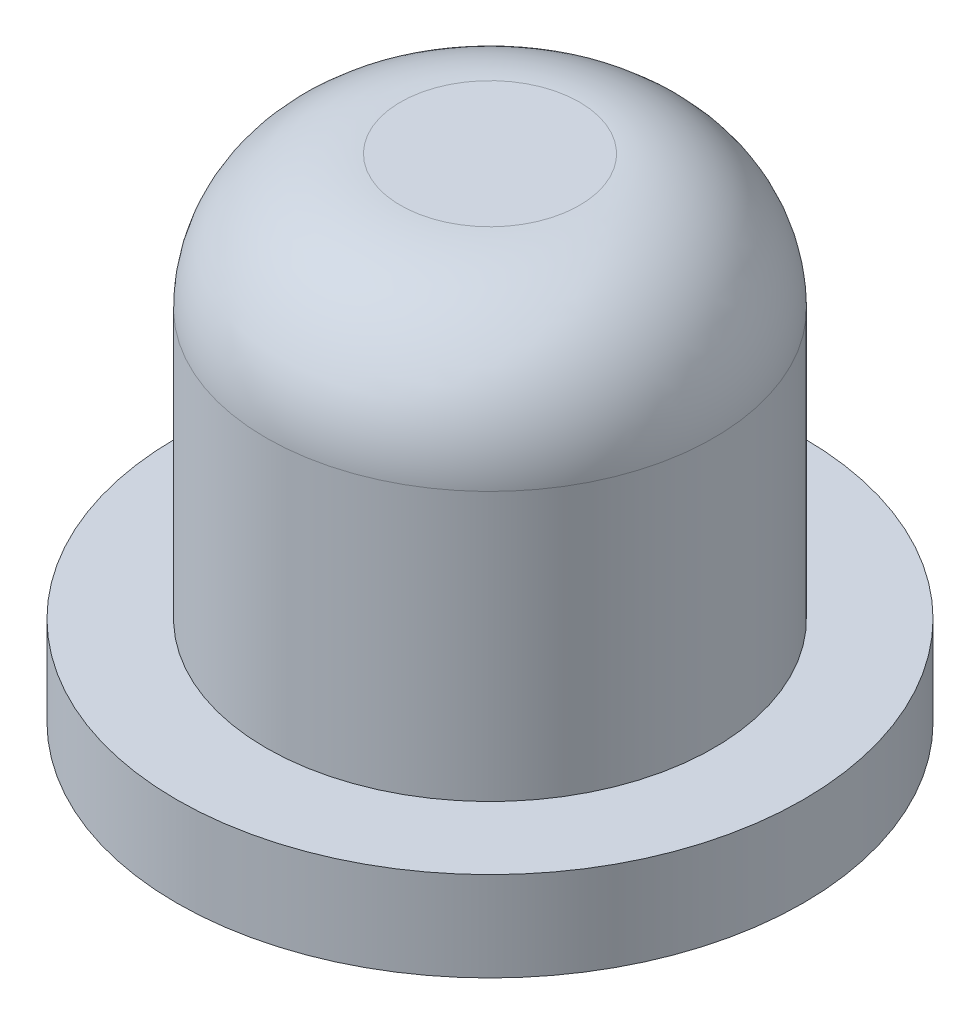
ISO-10303-21;
HEADER;
FILE_DESCRIPTION(('STEP AP214'),'2;1');
FILE_NAME('part.step','',(''),(''),'','','');
FILE_SCHEMA(('AUTOMOTIVE_DESIGN { 1 0 10303 214 1 1 1 1 }'));
ENDSEC;
DATA;
#1=APPLICATION_CONTEXT('core data for automotive mechanical design processes');
#2=APPLICATION_PROTOCOL_DEFINITION('international standard','automotive_design',2000,#1);
#3=PRODUCT_CONTEXT('',#1,'mechanical');
#4=PRODUCT('Part','Part','',(#3));
#5=PRODUCT_RELATED_PRODUCT_CATEGORY('part','',(#4));
#6=PRODUCT_DEFINITION_FORMATION('','',#4);
#7=PRODUCT_DEFINITION_CONTEXT('part definition',#1,'design');
#8=PRODUCT_DEFINITION('design','',#6,#7);
#9=PRODUCT_DEFINITION_SHAPE('','',#8);
#10=(LENGTH_UNIT() NAMED_UNIT(*) SI_UNIT(.MILLI.,.METRE.));
#11=(NAMED_UNIT(*) PLANE_ANGLE_UNIT() SI_UNIT($,.RADIAN.));
#12=(NAMED_UNIT(*) SI_UNIT($,.STERADIAN.) SOLID_ANGLE_UNIT());
#13=UNCERTAINTY_MEASURE_WITH_UNIT(LENGTH_MEASURE(1.E-05),#10,'distance_accuracy_value','');
#14=(GEOMETRIC_REPRESENTATION_CONTEXT(3) GLOBAL_UNCERTAINTY_ASSIGNED_CONTEXT((#13)) GLOBAL_UNIT_ASSIGNED_CONTEXT((#10,
#11,#12)) REPRESENTATION_CONTEXT('',''));
#15=CARTESIAN_POINT('',(0.,0.,0.));
#16=DIRECTION('',(0.,0.,1.));
#17=DIRECTION('',(1.,0.,0.));
#18=AXIS2_PLACEMENT_3D('',#15,#16,#17);
#19=CARTESIAN_POINT('',(0.,0.,0.));
#20=DIRECTION('',(0.,1.,0.));
#21=DIRECTION('',(0.,0.,1.));
#22=AXIS2_PLACEMENT_3D('',#19,#20,#21);
#23=PLANE('',#22);
#24=CARTESIAN_POINT('',(0.,0.,0.));
#25=DIRECTION('',(0.,1.,0.));
#26=DIRECTION('',(0.,0.,1.));
#27=AXIS2_PLACEMENT_3D('',#24,#25,#26);
#28=CIRCLE('',#27,1.5);
#29=CARTESIAN_POINT('',(0.,0.,1.5));
#30=VERTEX_POINT('',#29);
#31=EDGE_CURVE('E74',#30,#30,#28,.F.);
#32=ORIENTED_EDGE('',*,*,#31,.F.);
#33=EDGE_LOOP('',(#32));
#34=FACE_BOUND('',#33,.T.);
#35=CARTESIAN_POINT('',(0.,0.,0.));
#36=DIRECTION('',(0.,-1.,0.));
#37=DIRECTION('',(0.,0.,-1.));
#38=AXIS2_PLACEMENT_3D('',#35,#36,#37);
#39=CIRCLE('',#38,2.5);
#40=CARTESIAN_POINT('',(0.,0.,-2.5));
#41=VERTEX_POINT('',#40);
#42=EDGE_CURVE('E10',#41,#41,#39,.T.);
#43=ORIENTED_EDGE('',*,*,#42,.T.);
#44=EDGE_LOOP('',(#43));
#45=FACE_BOUND('',#44,.T.);
#46=ADVANCED_FACE('F39',(#34,#45),#23,.F.);
#47=CARTESIAN_POINT('',(0.,0.,0.));
#48=DIRECTION('',(0.,-1.,0.));
#49=DIRECTION('',(0.,0.,-1.));
#50=AXIS2_PLACEMENT_3D('',#47,#48,#49);
#51=CYLINDRICAL_SURFACE('',#50,2.5);
#52=ORIENTED_EDGE('',*,*,#42,.F.);
#53=EDGE_LOOP('',(#52));
#54=FACE_BOUND('',#53,.T.);
#55=CARTESIAN_POINT('',(0.,-0.500000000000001,0.));
#56=DIRECTION('',(0.,-1.,0.));
#57=DIRECTION('',(0.,0.,-1.));
#58=AXIS2_PLACEMENT_3D('',#55,#56,#57);
#59=CIRCLE('',#58,2.5);
#60=CARTESIAN_POINT('',(0.,-0.500000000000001,-2.5));
#61=VERTEX_POINT('',#60);
#62=EDGE_CURVE('E46',#61,#61,#59,.T.);
#63=ORIENTED_EDGE('',*,*,#62,.T.);
#64=EDGE_LOOP('',(#63));
#65=FACE_BOUND('',#64,.T.);
#66=ADVANCED_FACE('F105',(#54,#65),#51,.F.);
#67=CARTESIAN_POINT('',(-2.5,-0.500000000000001,0.));
#68=DIRECTION('',(0.,1.,0.));
#69=DIRECTION('',(0.,0.,1.));
#70=AXIS2_PLACEMENT_3D('',#67,#68,#69);
#71=PLANE('',#70);
#72=ORIENTED_EDGE('',*,*,#62,.F.);
#73=EDGE_LOOP('',(#72));
#74=FACE_BOUND('',#73,.T.);
#75=CARTESIAN_POINT('',(0.,-0.500000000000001,0.));
#76=DIRECTION('',(0.,-1.,0.));
#77=DIRECTION('',(0.,0.,-1.));
#78=AXIS2_PLACEMENT_3D('',#75,#76,#77);
#79=CIRCLE('',#78,3.5);
#80=CARTESIAN_POINT('',(0.,-0.500000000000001,-3.5));
#81=VERTEX_POINT('',#80);
#82=EDGE_CURVE('E51',#81,#81,#79,.T.);
#83=ORIENTED_EDGE('',*,*,#82,.T.);
#84=EDGE_LOOP('',(#83));
#85=FACE_BOUND('',#84,.T.);
#86=ADVANCED_FACE('F110',(#74,#85),#71,.F.);
#87=CARTESIAN_POINT('',(0.,0.,0.));
#88=DIRECTION('',(0.,-1.,0.));
#89=DIRECTION('',(0.,0.,-1.));
#90=AXIS2_PLACEMENT_3D('',#87,#88,#89);
#91=CYLINDRICAL_SURFACE('',#90,3.5);
#92=ORIENTED_EDGE('',*,*,#82,.F.);
#93=EDGE_LOOP('',(#92));
#94=FACE_BOUND('',#93,.T.);
#95=CARTESIAN_POINT('',(0.,0.499999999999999,0.));
#96=DIRECTION('',(0.,-1.,0.));
#97=DIRECTION('',(0.,0.,-1.));
#98=AXIS2_PLACEMENT_3D('',#95,#96,#97);
#99=CIRCLE('',#98,3.5);
#100=CARTESIAN_POINT('',(0.,0.499999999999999,-3.5));
#101=VERTEX_POINT('',#100);
#102=EDGE_CURVE('E56',#101,#101,#99,.T.);
#103=ORIENTED_EDGE('',*,*,#102,.T.);
#104=EDGE_LOOP('',(#103));
#105=FACE_BOUND('',#104,.T.);
#106=ADVANCED_FACE('F116',(#94,#105),#91,.T.);
#107=CARTESIAN_POINT('',(-3.5,0.499999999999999,0.));
#108=DIRECTION('',(0.,-1.,0.));
#109=DIRECTION('',(0.,0.,-1.));
#110=AXIS2_PLACEMENT_3D('',#107,#108,#109);
#111=PLANE('',#110);
#112=ORIENTED_EDGE('',*,*,#102,.F.);
#113=EDGE_LOOP('',(#112));
#114=FACE_BOUND('',#113,.T.);
#115=CARTESIAN_POINT('',(0.,0.499999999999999,0.));
#116=DIRECTION('',(0.,-1.,0.));
#117=DIRECTION('',(0.,0.,-1.));
#118=AXIS2_PLACEMENT_3D('',#115,#116,#117);
#119=CIRCLE('',#118,2.5);
#120=CARTESIAN_POINT('',(0.,0.499999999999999,-2.5));
#121=VERTEX_POINT('',#120);
#122=EDGE_CURVE('E62',#121,#121,#119,.T.);
#123=ORIENTED_EDGE('',*,*,#122,.T.);
#124=EDGE_LOOP('',(#123));
#125=FACE_BOUND('',#124,.T.);
#126=ADVANCED_FACE('F122',(#114,#125),#111,.F.);
#127=CARTESIAN_POINT('',(0.,0.,0.));
#128=DIRECTION('',(0.,-1.,0.));
#129=DIRECTION('',(0.,0.,-1.));
#130=AXIS2_PLACEMENT_3D('',#127,#128,#129);
#131=CYLINDRICAL_SURFACE('',#130,2.5);
#132=ORIENTED_EDGE('',*,*,#122,.F.);
#133=EDGE_LOOP('',(#132));
#134=FACE_BOUND('',#133,.T.);
#135=CARTESIAN_POINT('',(0.,3.5,0.));
#136=DIRECTION('',(0.,-1.,0.));
#137=DIRECTION('',(0.,0.,-1.));
#138=AXIS2_PLACEMENT_3D('',#135,#136,#137);
#139=CIRCLE('',#138,2.5);
#140=CARTESIAN_POINT('',(0.,3.5,-2.5));
#141=VERTEX_POINT('',#140);
#142=EDGE_CURVE('E66',#141,#141,#139,.T.);
#143=ORIENTED_EDGE('',*,*,#142,.T.);
#144=EDGE_LOOP('',(#143));
#145=FACE_BOUND('',#144,.T.);
#146=ADVANCED_FACE('F126',(#134,#145),#131,.T.);
#147=CARTESIAN_POINT('',(0.,3.5,0.));
#148=DIRECTION('',(0.,-1.,0.));
#149=DIRECTION('',(0.,0.,-1.));
#150=AXIS2_PLACEMENT_3D('',#147,#148,#149);
#151=DEGENERATE_TOROIDAL_SURFACE('',#150,1.,1.5,.T.);
#152=ORIENTED_EDGE('',*,*,#142,.F.);
#153=EDGE_LOOP('',(#152));
#154=FACE_BOUND('',#153,.T.);
#155=CARTESIAN_POINT('',(0.,5.,0.));
#156=DIRECTION('',(0.,-1.,0.));
#157=DIRECTION('',(0.,0.,-1.));
#158=AXIS2_PLACEMENT_3D('',#155,#156,#157);
#159=CIRCLE('',#158,1.);
#160=CARTESIAN_POINT('',(0.,5.,-1.));
#161=VERTEX_POINT('',#160);
#162=EDGE_CURVE('E70',#161,#161,#159,.T.);
#163=ORIENTED_EDGE('',*,*,#162,.T.);
#164=EDGE_LOOP('',(#163));
#165=FACE_BOUND('',#164,.T.);
#166=ADVANCED_FACE('F101',(#154,#165),#151,.T.);
#167=CARTESIAN_POINT('',(-1.,5.,0.));
#168=DIRECTION('',(0.,-1.,0.));
#169=DIRECTION('',(0.,0.,-1.));
#170=AXIS2_PLACEMENT_3D('',#167,#168,#169);
#171=PLANE('',#170);
#172=ORIENTED_EDGE('',*,*,#162,.F.);
#173=EDGE_LOOP('',(#172));
#174=FACE_BOUND('',#173,.T.);
#175=ADVANCED_FACE('F92',(#174),#171,.F.);
#176=CARTESIAN_POINT('',(0.,0.,0.));
#177=DIRECTION('',(0.,-1.,0.));
#178=DIRECTION('',(0.,0.,-1.));
#179=AXIS2_PLACEMENT_3D('',#176,#177,#178);
#180=CYLINDRICAL_SURFACE('',#179,1.5);
#181=ORIENTED_EDGE('',*,*,#31,.T.);
#182=EDGE_LOOP('',(#181));
#183=FACE_BOUND('',#182,.T.);
#184=CARTESIAN_POINT('',(0.,3.5,0.));
#185=DIRECTION('',(0.,-1.,0.));
#186=DIRECTION('',(0.,0.,-1.));
#187=AXIS2_PLACEMENT_3D('',#184,#185,#186);
#188=CIRCLE('',#187,1.5);
#189=CARTESIAN_POINT('',(0.,3.5,-1.5));
#190=VERTEX_POINT('',#189);
#191=EDGE_CURVE('E78',#190,#190,#188,.T.);
#192=ORIENTED_EDGE('',*,*,#191,.F.);
#193=EDGE_LOOP('',(#192));
#194=FACE_BOUND('',#193,.T.);
#195=ADVANCED_FACE('F90',(#183,#194),#180,.F.);
#196=CARTESIAN_POINT('',(0.,3.5,0.));
#197=DIRECTION('',(0.,-1.,0.));
#198=DIRECTION('',(0.,0.,-1.));
#199=AXIS2_PLACEMENT_3D('',#196,#197,#198);
#200=TOROIDAL_SURFACE('',#199,1.,0.5);
#201=ORIENTED_EDGE('',*,*,#191,.T.);
#202=EDGE_LOOP('',(#201));
#203=FACE_BOUND('',#202,.T.);
#204=CARTESIAN_POINT('',(0.,4.,0.));
#205=DIRECTION('',(0.,-1.,0.));
#206=DIRECTION('',(0.,0.,-1.));
#207=AXIS2_PLACEMENT_3D('',#204,#205,#206);
#208=CIRCLE('',#207,1.);
#209=CARTESIAN_POINT('',(0.,4.,-1.));
#210=VERTEX_POINT('',#209);
#211=EDGE_CURVE('E79',#210,#210,#208,.T.);
#212=ORIENTED_EDGE('',*,*,#211,.F.);
#213=EDGE_LOOP('',(#212));
#214=FACE_BOUND('',#213,.T.);
#215=ADVANCED_FACE('F87',(#203,#214),#200,.F.);
#216=CARTESIAN_POINT('',(-1.,4.,0.));
#217=DIRECTION('',(0.,-1.,0.));
#218=DIRECTION('',(0.,0.,-1.));
#219=AXIS2_PLACEMENT_3D('',#216,#217,#218);
#220=PLANE('',#219);
#221=ORIENTED_EDGE('',*,*,#211,.T.);
#222=EDGE_LOOP('',(#221));
#223=FACE_BOUND('',#222,.T.);
#224=ADVANCED_FACE('F99',(#223),#220,.T.);
#225=CLOSED_SHELL('',(#46,#66,#86,#106,#126,#146,#166,#175,#195,#215,#224));
#226=MANIFOLD_SOLID_BREP('B2',#225);
#227=ADVANCED_BREP_SHAPE_REPRESENTATION('',(#18,#226),#14);
#228=SHAPE_DEFINITION_REPRESENTATION(#9,#227);
ENDSEC;
END-ISO-10303-21;
